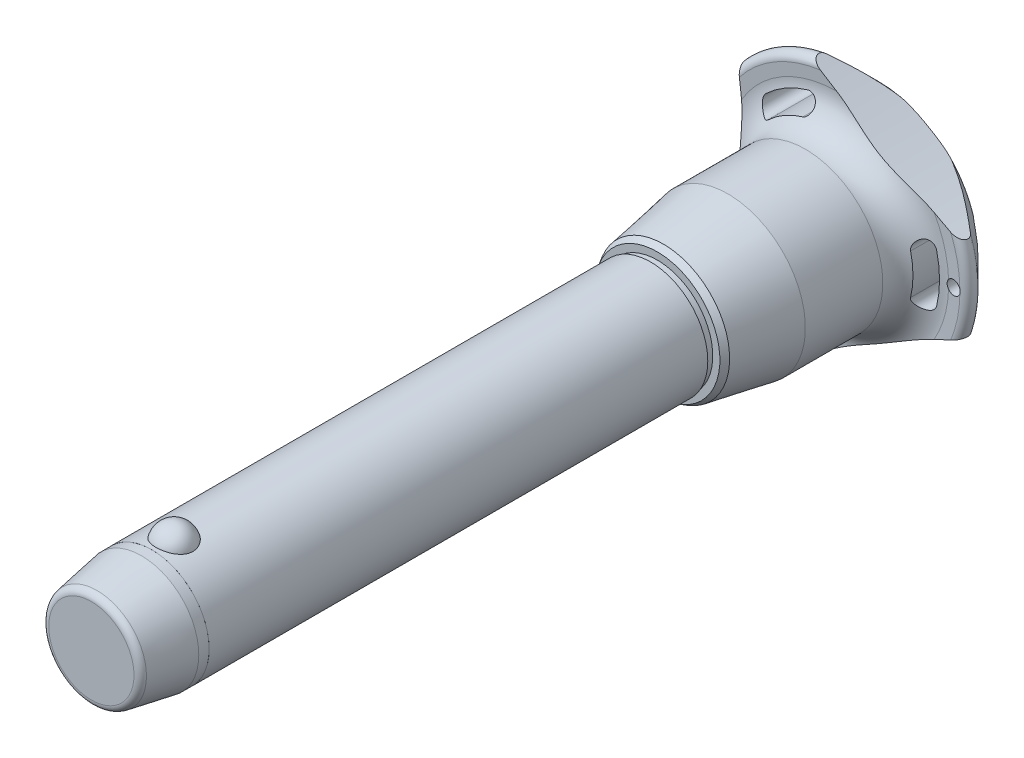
from build123d import *

# Parameters (mm, degrees)
SKETCH1_R           = 12.5
BOSS_EXTRUDE1_DEPTH = 100
SKETCH2_R           = 10
BOSS_EXTRUDE2_DEPTH = 50.7
BOSS_EXTRUDE3_START = 22
SKETCH1_2_R         = 12.5
BOSS_EXTRUDE3_DEPTH = 22
CHAMFER1_SIZE       = 11
CHAMFER1_SIZE2      = 1.939596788
FILLET1_R           = 1.5
SKETCH6_R           = 176.92625
CUT_EXTRUDE1_DEPTH  = 157.015516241
CIRPATTERN1_COUNT   = 3
SKETCH7_R           = 1.5
CUT_EXTRUDE2_DEPTH  = 156.917913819
SKETCH8_R           = 12.5
SKETCH8_R_2         = 12.49
CUT_EXTRUDE3_DEPTH  = 13.2


with BuildPart() as part:
    # Sketch1 → Boss-Extrude1 (new body)
    with BuildSketch(Plane.XY):
        Circle(SKETCH1_R)
    extrude(amount=-BOSS_EXTRUDE1_DEPTH)

    # Sketch2 → Boss-Extrude2 (add)
    with BuildSketch(Plane(origin=(0, 0, -100), x_dir=(-1, 0, 0), z_dir=(0, 0, -1))):
        with Locations(Location((0, 0, 0), (0, 0, 180))):
            Circle(SKETCH2_R)
    extrude(amount=BOSS_EXTRUDE2_DEPTH)

    # Sketch3 → Revolve1 (revolve)
    with BuildSketch(Plane(origin=(0, 0, 0), x_dir=(0, 0, -1), z_dir=(1, 0, 0))):
        with BuildLine():
            Line((-3.957271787, 15.4), (-3.957271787, 7.1))
            ThreePointArc((-3.957271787, 7.1), (0.192728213, 11.25), (-3.957271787, 15.4))
        make_face()
        with BuildLine():
            Line((-3.957271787, -7.1), (-3.957271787, -15.4))
            ThreePointArc((-3.957271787, -15.4), (0.192728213, -11.25), (-3.957271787, -7.1))
        make_face()
    revolve(axis=Axis((0, -7.1, 3.957271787), (0, 1, 0)))

    # Sketch1_2 → Boss-Extrude3 (add)
    with BuildSketch(Plane.XY.offset(BOSS_EXTRUDE3_START)):
        Circle(SKETCH1_2_R)
    extrude(amount=-BOSS_EXTRUDE3_DEPTH)

    # Chamfer1
    chamfer1_edges = [part.edges().sort_by_distance(p)[0] for p in [
        (-12.5, 0, 22),
    ]]
    chamfer1_side = [part.faces().sort_by_distance(p)[0] for p in [
        (-12.5, 0, -39),
    ]]
    chamfer(chamfer1_edges, length=CHAMFER1_SIZE, length2=CHAMFER1_SIZE2, reference=chamfer1_side[0])

    # Fillet1
    fillet1_edges = [part.edges().sort_by_distance(p)[0] for p in [
        (-10.560403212, 0, 22),
        (-10, 0, -150.7),
    ]]
    fillet(fillet1_edges, radius=FILLET1_R)

    # Sketch4 → Revolve2 (revolve)
    with BuildSketch(Plane(origin=(0, 0, 0), x_dir=(0, 0, -1), z_dir=(1, 0, 0)), mode=Mode.PRIVATE) as revolve2_sk:
        Polygon((100, 0), (100, 12.089202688), (101.5, 12.089202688), (101.5, 13.644437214), (102.846872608, 14.422054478), (116.9, 16.9), (133.8, 16.9), (133.8, 0), align=None)
    revolve(revolve2_sk.sketch.rotate(Axis((0, 0, -133.8), (0, 0, 1)), 90), axis=Axis((0, 0, -133.8), (0, 0, 1)))

    # Sketch5 → Revolve3 (revolve)
    with BuildSketch(Plane(origin=(0, 0, 0), x_dir=(0, 0, -1), z_dir=(1, 0, 0)), mode=Mode.PRIVATE) as revolve3_sk:
        with BuildLine():
            Line((140.790129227, 24.271609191), (140.652256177, 26.865060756))
            ThreePointArc((140.652256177, 26.865060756), (141.598671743, 28.411427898), (143.38137085, 28.08137085))
            Line((143.38137085, 28.08137085), (149.763226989, 21.69951471))
            ThreePointArc((149.763226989, 21.69951471), (150.7, 19.381044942), (149.683055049, 17.096604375))
            ThreePointArc((149.683055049, 17.096604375), (144.18864484, 9.321268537), (142.25, 0))
            Line((142.25, 0), (133.8, 0))
            Line((133.8, 0), (133.8, 16.9))
            ThreePointArc((133.8, 16.9), (138.879432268, 19.083427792), (140.790129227, 24.271609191))
        make_face()
    revolve(revolve3_sk.sketch.rotate(Axis((0, 0, -142.25), (0, 0, 1)), 90), axis=Axis((0, 0, -142.25), (0, 0, 1)))

    # Sketch6 → Cut-Extrude1 (cut, through all)
    with BuildSketch(Plane.XY):
        with Locations((-197.42625, 0)):
            Circle(SKETCH6_R)
        with BuildLine():
            ThreePointArc((21.802992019, -5.260839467), (22.428706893, 0), (21.802992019, 5.260839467))
            ThreePointArc((21.802992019, 5.260839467), (19.579234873, 6.620060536), (18.220013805, 4.39630339))
            ThreePointArc((18.220013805, 4.39630339), (18.742902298, 0), (18.220013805, -4.39630339))
            ThreePointArc((18.220013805, -4.39630339), (19.579234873, -6.620060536), (21.802992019, -5.260839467))
        make_face()
    cut_extrude1 = extrude(amount=-CUT_EXTRUDE1_DEPTH, mode=Mode.SUBTRACT)

    # CirPattern1: Cut-Extrude1 ×3 about axis
    cirpattern1_axis = Axis((0, 0, 0), (0, 0, 1))
    for i in range(1, CIRPATTERN1_COUNT):
        add(cut_extrude1.rotate(cirpattern1_axis, i * 360 / CIRPATTERN1_COUNT), mode=Mode.SUBTRACT)

    # Sketch7 → Cut-Extrude2 (cut, through all)
    with BuildSketch(Plane.XY):
        with Locations(Location((25.428706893, 0, 0), (0, 0, 17.230769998))):
            Circle(SKETCH7_R)
    extrude(amount=-CUT_EXTRUDE2_DEPTH, mode=Mode.SUBTRACT)

    # Sketch8 → Cut-Extrude3 (cut)
    with BuildSketch(Plane.XY.offset(22)):
        Circle(SKETCH8_R)
        Circle(SKETCH8_R_2, mode=Mode.SUBTRACT)
    extrude(amount=-CUT_EXTRUDE3_DEPTH, mode=Mode.SUBTRACT)


solid = part.part
